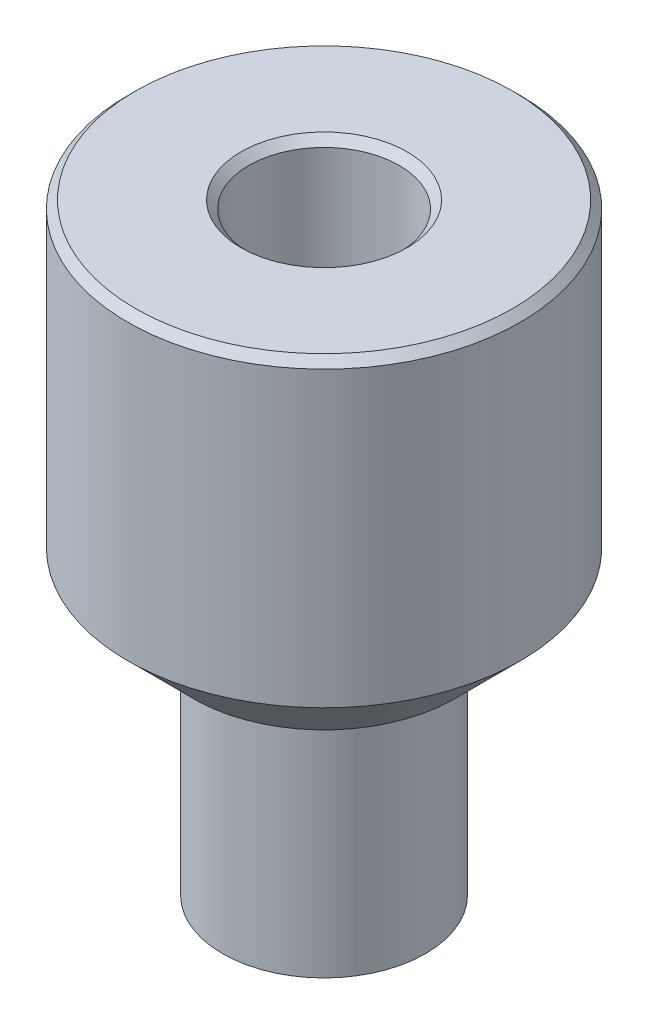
ISO-10303-21;
HEADER;
FILE_DESCRIPTION(('STEP AP214'),'2;1');
FILE_NAME('part.step','',(''),(''),'','','');
FILE_SCHEMA(('AUTOMOTIVE_DESIGN { 1 0 10303 214 1 1 1 1 }'));
ENDSEC;
DATA;
#1=APPLICATION_CONTEXT('core data for automotive mechanical design processes');
#2=APPLICATION_PROTOCOL_DEFINITION('international standard','automotive_design',2000,#1);
#3=PRODUCT_CONTEXT('',#1,'mechanical');
#4=PRODUCT('Part','Part','',(#3));
#5=PRODUCT_RELATED_PRODUCT_CATEGORY('part','',(#4));
#6=PRODUCT_DEFINITION_FORMATION('','',#4);
#7=PRODUCT_DEFINITION_CONTEXT('part definition',#1,'design');
#8=PRODUCT_DEFINITION('design','',#6,#7);
#9=PRODUCT_DEFINITION_SHAPE('','',#8);
#10=(LENGTH_UNIT() NAMED_UNIT(*) SI_UNIT(.MILLI.,.METRE.));
#11=(NAMED_UNIT(*) PLANE_ANGLE_UNIT() SI_UNIT($,.RADIAN.));
#12=(NAMED_UNIT(*) SI_UNIT($,.STERADIAN.) SOLID_ANGLE_UNIT());
#13=UNCERTAINTY_MEASURE_WITH_UNIT(LENGTH_MEASURE(1.E-05),#10,'distance_accuracy_value','');
#14=(GEOMETRIC_REPRESENTATION_CONTEXT(3) GLOBAL_UNCERTAINTY_ASSIGNED_CONTEXT((#13)) GLOBAL_UNIT_ASSIGNED_CONTEXT((#10,
#11,#12)) REPRESENTATION_CONTEXT('',''));
#15=CARTESIAN_POINT('',(0.,0.,0.));
#16=DIRECTION('',(0.,0.,1.));
#17=DIRECTION('',(1.,0.,0.));
#18=AXIS2_PLACEMENT_3D('',#15,#16,#17);
#19=CARTESIAN_POINT('',(0.,0.,0.));
#20=DIRECTION('',(0.,1.,0.));
#21=DIRECTION('',(0.,0.,1.));
#22=AXIS2_PLACEMENT_3D('',#19,#20,#21);
#23=PLANE('',#22);
#24=DIRECTION('',(0.,0.,1.));
#25=VECTOR('',#24,1.);
#26=CARTESIAN_POINT('',(1.6,0.,-2.04939015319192));
#27=LINE('',#26,#25);
#28=CARTESIAN_POINT('',(1.6,0.,-2.04939015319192));
#29=VERTEX_POINT('',#28);
#30=CARTESIAN_POINT('',(1.6,0.,2.04939015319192));
#31=VERTEX_POINT('',#30);
#32=EDGE_CURVE('E83',#29,#31,#27,.T.);
#33=ORIENTED_EDGE('',*,*,#32,.F.);
#34=CARTESIAN_POINT('',(0.,0.,0.));
#35=DIRECTION('',(0.,-1.,0.));
#36=DIRECTION('',(0.,0.,-1.));
#37=AXIS2_PLACEMENT_3D('',#34,#35,#36);
#38=CIRCLE('',#37,2.6);
#39=CARTESIAN_POINT('',(-1.6,0.,-2.04939015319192));
#40=VERTEX_POINT('',#39);
#41=EDGE_CURVE('E48',#40,#29,#38,.T.);
#42=ORIENTED_EDGE('',*,*,#41,.F.);
#43=DIRECTION('',(0.,0.,-1.));
#44=VECTOR('',#43,1.);
#45=CARTESIAN_POINT('',(-1.6,0.,-2.04939015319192));
#46=LINE('',#45,#44);
#47=CARTESIAN_POINT('',(-1.6,0.,2.04939015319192));
#48=VERTEX_POINT('',#47);
#49=EDGE_CURVE('E99',#48,#40,#46,.T.);
#50=ORIENTED_EDGE('',*,*,#49,.F.);
#51=CARTESIAN_POINT('',(0.,0.,0.));
#52=DIRECTION('',(0.,-1.,0.));
#53=DIRECTION('',(0.,0.,-1.));
#54=AXIS2_PLACEMENT_3D('',#51,#52,#53);
#55=CIRCLE('',#54,2.6);
#56=EDGE_CURVE('E105',#31,#48,#55,.T.);
#57=ORIENTED_EDGE('',*,*,#56,.F.);
#58=EDGE_LOOP('',(#33,#42,#50,#57));
#59=FACE_BOUND('',#58,.T.);
#60=CARTESIAN_POINT('',(0.,0.,0.));
#61=DIRECTION('',(0.,-1.,0.));
#62=DIRECTION('',(0.,0.,-1.));
#63=AXIS2_PLACEMENT_3D('',#60,#61,#62);
#64=CIRCLE('',#63,7.75);
#65=CARTESIAN_POINT('',(0.,0.,-7.75));
#66=VERTEX_POINT('',#65);
#67=EDGE_CURVE('E129',#66,#66,#64,.T.);
#68=ORIENTED_EDGE('',*,*,#67,.T.);
#69=EDGE_LOOP('',(#68));
#70=FACE_BOUND('',#69,.T.);
#71=ADVANCED_FACE('F33',(#59,#70),#23,.F.);
#72=CARTESIAN_POINT('',(0.,0.,0.));
#73=DIRECTION('',(0.,-1.,0.));
#74=DIRECTION('',(0.,0.,-1.));
#75=AXIS2_PLACEMENT_3D('',#72,#73,#74);
#76=CYLINDRICAL_SURFACE('',#75,7.75);
#77=ORIENTED_EDGE('',*,*,#67,.F.);
#78=EDGE_LOOP('',(#77));
#79=FACE_BOUND('',#78,.T.);
#80=CARTESIAN_POINT('',(0.,17.4,0.));
#81=DIRECTION('',(0.,-1.,0.));
#82=DIRECTION('',(0.,0.,-1.));
#83=AXIS2_PLACEMENT_3D('',#80,#81,#82);
#84=CIRCLE('',#83,7.75);
#85=CARTESIAN_POINT('',(0.,17.4,-7.75));
#86=VERTEX_POINT('',#85);
#87=EDGE_CURVE('E126',#86,#86,#84,.T.);
#88=ORIENTED_EDGE('',*,*,#87,.T.);
#89=EDGE_LOOP('',(#88));
#90=FACE_BOUND('',#89,.T.);
#91=ADVANCED_FACE('F167',(#79,#90),#76,.T.);
#92=CARTESIAN_POINT('',(0.,17.4,0.));
#93=DIRECTION('',(0.,-1.,0.));
#94=DIRECTION('',(0.,0.,-1.));
#95=AXIS2_PLACEMENT_3D('',#92,#93,#94);
#96=TOROIDAL_SURFACE('',#95,8.35,0.599999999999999);
#97=ORIENTED_EDGE('',*,*,#87,.F.);
#98=EDGE_LOOP('',(#97));
#99=FACE_BOUND('',#98,.T.);
#100=CARTESIAN_POINT('',(0.,18.,0.));
#101=DIRECTION('',(0.,-1.,0.));
#102=DIRECTION('',(0.,0.,-1.));
#103=AXIS2_PLACEMENT_3D('',#100,#101,#102);
#104=CIRCLE('',#103,8.35);
#105=CARTESIAN_POINT('',(0.,18.,-8.35));
#106=VERTEX_POINT('',#105);
#107=EDGE_CURVE('E123',#106,#106,#104,.T.);
#108=ORIENTED_EDGE('',*,*,#107,.T.);
#109=EDGE_LOOP('',(#108));
#110=FACE_BOUND('',#109,.T.);
#111=ADVANCED_FACE('F162',(#99,#110),#96,.F.);
#112=CARTESIAN_POINT('',(-8.35,18.,0.));
#113=DIRECTION('',(0.,1.,0.));
#114=DIRECTION('',(0.,0.,1.));
#115=AXIS2_PLACEMENT_3D('',#112,#113,#114);
#116=PLANE('',#115);
#117=ORIENTED_EDGE('',*,*,#107,.F.);
#118=EDGE_LOOP('',(#117));
#119=FACE_BOUND('',#118,.T.);
#120=CARTESIAN_POINT('',(0.,18.,0.));
#121=DIRECTION('',(0.,-1.,0.));
#122=DIRECTION('',(0.,0.,-1.));
#123=AXIS2_PLACEMENT_3D('',#120,#121,#122);
#124=CIRCLE('',#123,10.);
#125=CARTESIAN_POINT('',(0.,18.,-10.));
#126=VERTEX_POINT('',#125);
#127=EDGE_CURVE('E120',#126,#126,#124,.T.);
#128=ORIENTED_EDGE('',*,*,#127,.T.);
#129=EDGE_LOOP('',(#128));
#130=FACE_BOUND('',#129,.T.);
#131=ADVANCED_FACE('F156',(#119,#130),#116,.F.);
#132=CARTESIAN_POINT('',(0.,23.,0.));
#133=DIRECTION('',(0.,1.,0.));
#134=DIRECTION('',(0.,0.,1.));
#135=AXIS2_PLACEMENT_3D('',#132,#133,#134);
#136=CONICAL_SURFACE('',#135,15.,0.785398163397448);
#137=ORIENTED_EDGE('',*,*,#127,.F.);
#138=EDGE_LOOP('',(#137));
#139=FACE_BOUND('',#138,.T.);
#140=CARTESIAN_POINT('',(0.,23.,0.));
#141=DIRECTION('',(0.,-1.,0.));
#142=DIRECTION('',(0.,0.,-1.));
#143=AXIS2_PLACEMENT_3D('',#140,#141,#142);
#144=CIRCLE('',#143,15.);
#145=CARTESIAN_POINT('',(0.,23.,-15.));
#146=VERTEX_POINT('',#145);
#147=EDGE_CURVE('E117',#146,#146,#144,.T.);
#148=ORIENTED_EDGE('',*,*,#147,.T.);
#149=EDGE_LOOP('',(#148));
#150=FACE_BOUND('',#149,.T.);
#151=ADVANCED_FACE('F151',(#139,#150),#136,.T.);
#152=CARTESIAN_POINT('',(0.,0.,0.));
#153=DIRECTION('',(0.,-1.,0.));
#154=DIRECTION('',(0.,0.,-1.));
#155=AXIS2_PLACEMENT_3D('',#152,#153,#154);
#156=CYLINDRICAL_SURFACE('',#155,15.);
#157=CARTESIAN_POINT('',(0.,45.4,0.));
#158=DIRECTION('',(0.,-1.,0.));
#159=DIRECTION('',(0.,0.,-1.));
#160=AXIS2_PLACEMENT_3D('',#157,#158,#159);
#161=CIRCLE('',#160,15.);
#162=CARTESIAN_POINT('',(0.,45.4,-15.));
#163=VERTEX_POINT('',#162);
#164=EDGE_CURVE('E132',#163,#163,#161,.T.);
#165=ORIENTED_EDGE('',*,*,#164,.T.);
#166=EDGE_LOOP('',(#165));
#167=FACE_BOUND('',#166,.T.);
#168=ORIENTED_EDGE('',*,*,#147,.F.);
#169=EDGE_LOOP('',(#168));
#170=FACE_BOUND('',#169,.T.);
#171=ADVANCED_FACE('F148',(#167,#170),#156,.T.);
#172=CARTESIAN_POINT('',(-15.,46.,0.));
#173=DIRECTION('',(0.,-1.,0.));
#174=DIRECTION('',(0.,0.,-1.));
#175=AXIS2_PLACEMENT_3D('',#172,#173,#174);
#176=PLANE('',#175);
#177=CARTESIAN_POINT('',(0.,46.,0.));
#178=DIRECTION('',(0.,-1.,0.));
#179=DIRECTION('',(0.,0.,-1.));
#180=AXIS2_PLACEMENT_3D('',#177,#178,#179);
#181=CIRCLE('',#180,14.4);
#182=CARTESIAN_POINT('',(0.,46.,-14.4));
#183=VERTEX_POINT('',#182);
#184=EDGE_CURVE('E41',#183,#183,#181,.F.);
#185=ORIENTED_EDGE('',*,*,#184,.T.);
#186=EDGE_LOOP('',(#185));
#187=FACE_BOUND('',#186,.T.);
#188=CARTESIAN_POINT('',(0.,46.,0.));
#189=DIRECTION('',(0.,-1.,0.));
#190=DIRECTION('',(0.,0.,-1.));
#191=AXIS2_PLACEMENT_3D('',#188,#189,#190);
#192=CIRCLE('',#191,6.35000000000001);
#193=CARTESIAN_POINT('',(0.,46.,6.35000000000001));
#194=VERTEX_POINT('',#193);
#195=EDGE_CURVE('E135',#194,#194,#192,.T.);
#196=ORIENTED_EDGE('',*,*,#195,.T.);
#197=EDGE_LOOP('',(#196));
#198=FACE_BOUND('',#197,.T.);
#199=ADVANCED_FACE('F140',(#187,#198),#176,.F.);
#200=CARTESIAN_POINT('',(0.,0.,0.));
#201=DIRECTION('',(0.,-1.,0.));
#202=DIRECTION('',(0.,0.,-1.));
#203=AXIS2_PLACEMENT_3D('',#200,#201,#202);
#204=CYLINDRICAL_SURFACE('',#203,5.75);
#205=CARTESIAN_POINT('',(0.,45.4,0.));
#206=DIRECTION('',(0.,-1.,0.));
#207=DIRECTION('',(0.,0.,-1.));
#208=AXIS2_PLACEMENT_3D('',#205,#206,#207);
#209=CIRCLE('',#208,5.75);
#210=CARTESIAN_POINT('',(0.,45.4,5.75));
#211=VERTEX_POINT('',#210);
#212=EDGE_CURVE('E11',#211,#211,#209,.F.);
#213=ORIENTED_EDGE('',*,*,#212,.T.);
#214=EDGE_LOOP('',(#213));
#215=FACE_BOUND('',#214,.T.);
#216=CARTESIAN_POINT('',(0.,23.5,0.));
#217=DIRECTION('',(0.,-1.,0.));
#218=DIRECTION('',(0.,0.,-1.));
#219=AXIS2_PLACEMENT_3D('',#216,#217,#218);
#220=CIRCLE('',#219,5.75);
#221=CARTESIAN_POINT('',(0.,23.5,-5.75));
#222=VERTEX_POINT('',#221);
#223=EDGE_CURVE('E114',#222,#222,#220,.T.);
#224=ORIENTED_EDGE('',*,*,#223,.T.);
#225=EDGE_LOOP('',(#224));
#226=FACE_BOUND('',#225,.T.);
#227=ADVANCED_FACE('F208',(#215,#226),#204,.F.);
#228=CARTESIAN_POINT('',(0.,23.5,0.));
#229=DIRECTION('',(0.,-1.,0.));
#230=DIRECTION('',(0.,0.,-1.));
#231=AXIS2_PLACEMENT_3D('',#228,#229,#230);
#232=TOROIDAL_SURFACE('',#231,4.25,1.5);
#233=ORIENTED_EDGE('',*,*,#223,.F.);
#234=EDGE_LOOP('',(#233));
#235=FACE_BOUND('',#234,.T.);
#236=CARTESIAN_POINT('',(0.,22.,0.));
#237=DIRECTION('',(0.,-1.,0.));
#238=DIRECTION('',(0.,0.,-1.));
#239=AXIS2_PLACEMENT_3D('',#236,#237,#238);
#240=CIRCLE('',#239,4.25);
#241=CARTESIAN_POINT('',(0.,22.,-4.25));
#242=VERTEX_POINT('',#241);
#243=EDGE_CURVE('E109',#242,#242,#240,.T.);
#244=ORIENTED_EDGE('',*,*,#243,.T.);
#245=EDGE_LOOP('',(#244));
#246=FACE_BOUND('',#245,.T.);
#247=ADVANCED_FACE('F202',(#235,#246),#232,.F.);
#248=CARTESIAN_POINT('',(-4.25,22.,0.));
#249=DIRECTION('',(0.,-1.,0.));
#250=DIRECTION('',(0.,0.,-1.));
#251=AXIS2_PLACEMENT_3D('',#248,#249,#250);
#252=PLANE('',#251);
#253=ORIENTED_EDGE('',*,*,#243,.F.);
#254=EDGE_LOOP('',(#253));
#255=FACE_BOUND('',#254,.T.);
#256=ADVANCED_FACE('F207',(#255),#252,.F.);
#257=CARTESIAN_POINT('',(0.,8.,0.));
#258=DIRECTION('',(0.,-1.,0.));
#259=DIRECTION('',(0.,0.,-1.));
#260=AXIS2_PLACEMENT_3D('',#257,#258,#259);
#261=CYLINDRICAL_SURFACE('',#260,2.6);
#262=ORIENTED_EDGE('',*,*,#41,.T.);
#263=DIRECTION('',(0.,-1.,0.));
#264=VECTOR('',#263,1.);
#265=CARTESIAN_POINT('',(1.6,8.,-2.04939015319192));
#266=LINE('',#265,#264);
#267=CARTESIAN_POINT('',(1.6,8.,-2.04939015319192));
#268=VERTEX_POINT('',#267);
#269=EDGE_CURVE('E71',#268,#29,#266,.T.);
#270=ORIENTED_EDGE('',*,*,#269,.F.);
#271=CARTESIAN_POINT('',(0.,8.,0.));
#272=DIRECTION('',(0.,-1.,0.));
#273=DIRECTION('',(0.,0.,-1.));
#274=AXIS2_PLACEMENT_3D('',#271,#272,#273);
#275=CIRCLE('',#274,2.6);
#276=CARTESIAN_POINT('',(-1.6,8.,-2.04939015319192));
#277=VERTEX_POINT('',#276);
#278=EDGE_CURVE('E97',#277,#268,#275,.T.);
#279=ORIENTED_EDGE('',*,*,#278,.F.);
#280=DIRECTION('',(0.,-1.,0.));
#281=VECTOR('',#280,1.);
#282=CARTESIAN_POINT('',(-1.6,8.,-2.04939015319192));
#283=LINE('',#282,#281);
#284=EDGE_CURVE('E56',#277,#40,#283,.T.);
#285=ORIENTED_EDGE('',*,*,#284,.T.);
#286=EDGE_LOOP('',(#262,#270,#279,#285));
#287=FACE_BOUND('',#286,.T.);
#288=ADVANCED_FACE('F219',(#287),#261,.F.);
#289=CARTESIAN_POINT('',(-1.6,8.,-2.04939015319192));
#290=DIRECTION('',(-1.,0.,0.));
#291=DIRECTION('',(0.,0.,1.));
#292=AXIS2_PLACEMENT_3D('',#289,#290,#291);
#293=PLANE('',#292);
#294=ORIENTED_EDGE('',*,*,#49,.T.);
#295=ORIENTED_EDGE('',*,*,#284,.F.);
#296=DIRECTION('',(0.,0.,-1.));
#297=VECTOR('',#296,1.);
#298=CARTESIAN_POINT('',(-1.6,8.,-2.04939015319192));
#299=LINE('',#298,#297);
#300=CARTESIAN_POINT('',(-1.6,8.,2.04939015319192));
#301=VERTEX_POINT('',#300);
#302=EDGE_CURVE('E94',#301,#277,#299,.T.);
#303=ORIENTED_EDGE('',*,*,#302,.F.);
#304=DIRECTION('',(0.,-1.,0.));
#305=VECTOR('',#304,1.);
#306=CARTESIAN_POINT('',(-1.6,8.,2.04939015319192));
#307=LINE('',#306,#305);
#308=EDGE_CURVE('E87',#301,#48,#307,.T.);
#309=ORIENTED_EDGE('',*,*,#308,.T.);
#310=EDGE_LOOP('',(#294,#295,#303,#309));
#311=FACE_BOUND('',#310,.T.);
#312=ADVANCED_FACE('F235',(#311),#293,.F.);
#313=CARTESIAN_POINT('',(0.,8.,0.));
#314=DIRECTION('',(0.,-1.,0.));
#315=DIRECTION('',(0.,0.,-1.));
#316=AXIS2_PLACEMENT_3D('',#313,#314,#315);
#317=CYLINDRICAL_SURFACE('',#316,2.6);
#318=ORIENTED_EDGE('',*,*,#56,.T.);
#319=ORIENTED_EDGE('',*,*,#308,.F.);
#320=CARTESIAN_POINT('',(0.,8.,0.));
#321=DIRECTION('',(0.,-1.,0.));
#322=DIRECTION('',(0.,0.,-1.));
#323=AXIS2_PLACEMENT_3D('',#320,#321,#322);
#324=CIRCLE('',#323,2.6);
#325=CARTESIAN_POINT('',(1.6,8.,2.04939015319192));
#326=VERTEX_POINT('',#325);
#327=EDGE_CURVE('E90',#326,#301,#324,.T.);
#328=ORIENTED_EDGE('',*,*,#327,.F.);
#329=DIRECTION('',(0.,-1.,0.));
#330=VECTOR('',#329,1.);
#331=CARTESIAN_POINT('',(1.6,8.,2.04939015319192));
#332=LINE('',#331,#330);
#333=EDGE_CURVE('E76',#326,#31,#332,.T.);
#334=ORIENTED_EDGE('',*,*,#333,.T.);
#335=EDGE_LOOP('',(#318,#319,#328,#334));
#336=FACE_BOUND('',#335,.T.);
#337=ADVANCED_FACE('F91',(#336),#317,.F.);
#338=CARTESIAN_POINT('',(1.6,8.,-2.04939015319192));
#339=DIRECTION('',(1.,0.,0.));
#340=DIRECTION('',(0.,0.,-1.));
#341=AXIS2_PLACEMENT_3D('',#338,#339,#340);
#342=PLANE('',#341);
#343=ORIENTED_EDGE('',*,*,#32,.T.);
#344=ORIENTED_EDGE('',*,*,#333,.F.);
#345=DIRECTION('',(0.,0.,1.));
#346=VECTOR('',#345,1.);
#347=CARTESIAN_POINT('',(1.6,8.,-2.04939015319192));
#348=LINE('',#347,#346);
#349=EDGE_CURVE('E80',#268,#326,#348,.T.);
#350=ORIENTED_EDGE('',*,*,#349,.F.);
#351=ORIENTED_EDGE('',*,*,#269,.T.);
#352=EDGE_LOOP('',(#343,#344,#350,#351));
#353=FACE_BOUND('',#352,.T.);
#354=ADVANCED_FACE('F78',(#353),#342,.F.);
#355=CARTESIAN_POINT('',(0.,8.,0.));
#356=DIRECTION('',(0.,-1.,0.));
#357=DIRECTION('',(0.,0.,-1.));
#358=AXIS2_PLACEMENT_3D('',#355,#356,#357);
#359=PLANE('',#358);
#360=ORIENTED_EDGE('',*,*,#278,.T.);
#361=ORIENTED_EDGE('',*,*,#349,.T.);
#362=ORIENTED_EDGE('',*,*,#327,.T.);
#363=ORIENTED_EDGE('',*,*,#302,.T.);
#364=EDGE_LOOP('',(#360,#361,#362,#363));
#365=FACE_BOUND('',#364,.T.);
#366=ADVANCED_FACE('F96',(#365),#359,.T.);
#367=CARTESIAN_POINT('',(0.,45.4,0.));
#368=DIRECTION('',(0.,-1.,0.));
#369=DIRECTION('',(0.,0.,-1.));
#370=AXIS2_PLACEMENT_3D('',#367,#368,#369);
#371=CONICAL_SURFACE('',#370,15.,0.785398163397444);
#372=ORIENTED_EDGE('',*,*,#184,.F.);
#373=EDGE_LOOP('',(#372));
#374=FACE_BOUND('',#373,.T.);
#375=ORIENTED_EDGE('',*,*,#164,.F.);
#376=EDGE_LOOP('',(#375));
#377=FACE_BOUND('',#376,.T.);
#378=ADVANCED_FACE('F143',(#374,#377),#371,.T.);
#379=CARTESIAN_POINT('',(0.,46.,0.));
#380=DIRECTION('',(0.,1.,0.));
#381=DIRECTION('',(0.,0.,1.));
#382=AXIS2_PLACEMENT_3D('',#379,#380,#381);
#383=CONICAL_SURFACE('',#382,6.35000000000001,0.785398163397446);
#384=CARTESIAN_POINT('',(0.,45.4,5.75));
#385=CARTESIAN_POINT('',(0.,45.40625,5.75625));
#386=CARTESIAN_POINT('',(0.,45.4125,5.7625));
#387=CARTESIAN_POINT('',(0.,45.425,5.775));
#388=CARTESIAN_POINT('',(0.,45.43125,5.78125000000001));
#389=CARTESIAN_POINT('',(0.,45.44375,5.79375000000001));
#390=CARTESIAN_POINT('',(0.,45.45,5.80000000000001));
#391=CARTESIAN_POINT('',(0.,45.4625,5.8125));
#392=CARTESIAN_POINT('',(0.,45.46875,5.81875));
#393=CARTESIAN_POINT('',(0.,45.48125,5.83125000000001));
#394=CARTESIAN_POINT('',(0.,45.4875,5.83750000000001));
#395=CARTESIAN_POINT('',(0.,45.5,5.85));
#396=CARTESIAN_POINT('',(0.,45.50625,5.85625000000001));
#397=CARTESIAN_POINT('',(0.,45.51875,5.86875));
#398=CARTESIAN_POINT('',(0.,45.525,5.87500000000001));
#399=CARTESIAN_POINT('',(0.,45.5375,5.88750000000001));
#400=CARTESIAN_POINT('',(0.,45.54375,5.89375000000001));
#401=CARTESIAN_POINT('',(0.,45.55625,5.90625000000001));
#402=CARTESIAN_POINT('',(0.,45.5625,5.91250000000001));
#403=CARTESIAN_POINT('',(0.,45.575,5.92500000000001));
#404=CARTESIAN_POINT('',(0.,45.58125,5.93125000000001));
#405=CARTESIAN_POINT('',(0.,45.59375,5.94375000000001));
#406=CARTESIAN_POINT('',(0.,45.6,5.95000000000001));
#407=CARTESIAN_POINT('',(0.,45.6125,5.96250000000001));
#408=CARTESIAN_POINT('',(0.,45.61875,5.96875000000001));
#409=CARTESIAN_POINT('',(0.,45.63125,5.98125000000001));
#410=CARTESIAN_POINT('',(0.,45.6375,5.98750000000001));
#411=CARTESIAN_POINT('',(0.,45.65,6.00000000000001));
#412=CARTESIAN_POINT('',(0.,45.65625,6.00625000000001));
#413=CARTESIAN_POINT('',(0.,45.66875,6.01875000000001));
#414=CARTESIAN_POINT('',(0.,45.675,6.02500000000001));
#415=CARTESIAN_POINT('',(0.,45.6875,6.03750000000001));
#416=CARTESIAN_POINT('',(0.,45.69375,6.04375000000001));
#417=CARTESIAN_POINT('',(0.,45.70625,6.05625000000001));
#418=CARTESIAN_POINT('',(0.,45.7125,6.06250000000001));
#419=CARTESIAN_POINT('',(0.,45.725,6.07500000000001));
#420=CARTESIAN_POINT('',(0.,45.73125,6.08125000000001));
#421=CARTESIAN_POINT('',(0.,45.74375,6.09375000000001));
#422=CARTESIAN_POINT('',(0.,45.75,6.10000000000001));
#423=CARTESIAN_POINT('',(0.,45.7625,6.11250000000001));
#424=CARTESIAN_POINT('',(0.,45.76875,6.11875000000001));
#425=CARTESIAN_POINT('',(0.,45.78125,6.13125000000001));
#426=CARTESIAN_POINT('',(0.,45.7875,6.13750000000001));
#427=CARTESIAN_POINT('',(0.,45.8,6.15000000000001));
#428=CARTESIAN_POINT('',(0.,45.80625,6.15625000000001));
#429=CARTESIAN_POINT('',(0.,45.81875,6.16875000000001));
#430=CARTESIAN_POINT('',(0.,45.825,6.17500000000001));
#431=CARTESIAN_POINT('',(0.,45.8375,6.18750000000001));
#432=CARTESIAN_POINT('',(0.,45.84375,6.19375000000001));
#433=CARTESIAN_POINT('',(0.,45.85625,6.20625000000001));
#434=CARTESIAN_POINT('',(0.,45.8625,6.21250000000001));
#435=CARTESIAN_POINT('',(0.,45.875,6.22500000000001));
#436=CARTESIAN_POINT('',(0.,45.88125,6.23125000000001));
#437=CARTESIAN_POINT('',(0.,45.89375,6.24375000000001));
#438=CARTESIAN_POINT('',(0.,45.9,6.25000000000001));
#439=CARTESIAN_POINT('',(0.,45.9125,6.26250000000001));
#440=CARTESIAN_POINT('',(0.,45.91875,6.26875000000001));
#441=CARTESIAN_POINT('',(0.,45.93125,6.28125000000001));
#442=CARTESIAN_POINT('',(0.,45.9375,6.28750000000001));
#443=CARTESIAN_POINT('',(0.,45.95,6.30000000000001));
#444=CARTESIAN_POINT('',(0.,45.95625,6.30625000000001));
#445=CARTESIAN_POINT('',(0.,45.96875,6.31875000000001));
#446=CARTESIAN_POINT('',(0.,45.975,6.32500000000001));
#447=CARTESIAN_POINT('',(0.,45.9875,6.33750000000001));
#448=CARTESIAN_POINT('',(0.,45.99375,6.34375000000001));
#449=CARTESIAN_POINT('',(0.,46.,6.35000000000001));
#450=B_SPLINE_CURVE_WITH_KNOTS('',3,(#384,#385,#386,#387,#388,#389,#390,#391,#392,#393,#394,
#395,#396,#397,#398,#399,#400,#401,#402,#403,#404,#405,#406,#407,#408,#409,#410,#411,#412,#413,
#414,#415,#416,#417,#418,#419,#420,#421,#422,#423,#424,#425,#426,#427,#428,#429,#430,#431,#432,
#433,#434,#435,#436,#437,#438,#439,#440,#441,#442,#443,#444,#445,#446,#447,#448,#449),
.UNSPECIFIED.,.F.,.F.,(4,2,2,2,2,2,2,2,2,2,2,2,2,2,2,2,2,2,2,2,2,2,2,2,2,2,2,2,2,2,2,2,4),(0.,
0.0265165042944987,0.0530330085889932,0.0795495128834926,0.106066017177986,0.132582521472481,
0.15909902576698,0.185615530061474,0.212132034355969,0.238648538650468,0.265165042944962,
0.291681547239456,0.318198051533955,0.344714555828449,0.371231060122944,0.397747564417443,
0.424264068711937,0.450780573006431,0.477297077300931,0.503813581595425,0.530330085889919,
0.556846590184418,0.583363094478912,0.609879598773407,0.636396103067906,0.6629126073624,
0.689429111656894,0.715945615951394,0.742462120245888,0.768978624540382,0.795495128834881,
0.822011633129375,0.84852813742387),.UNSPECIFIED.);
#451=EDGE_CURVE('BSEAM35',#211,#194,#450,.T.);
#452=ORIENTED_EDGE('',*,*,#212,.F.);
#453=ORIENTED_EDGE('',*,*,#195,.F.);
#454=ORIENTED_EDGE('',*,*,#451,.T.);
#455=ORIENTED_EDGE('',*,*,#451,.F.);
#456=EDGE_LOOP('',(#452,#454,#453,#455));
#457=FACE_BOUND('',#456,.T.);
#458=ADVANCED_FACE('F35',(#457),#383,.F.);
#459=CLOSED_SHELL('',(#71,#91,#111,#131,#151,#171,#199,#227,#247,#256,#288,#312,#337,#354,#366,
#378,#458));
#460=MANIFOLD_SOLID_BREP('B2',#459);
#461=ADVANCED_BREP_SHAPE_REPRESENTATION('',(#18,#460),#14);
#462=SHAPE_DEFINITION_REPRESENTATION(#9,#461);
ENDSEC;
END-ISO-10303-21;
